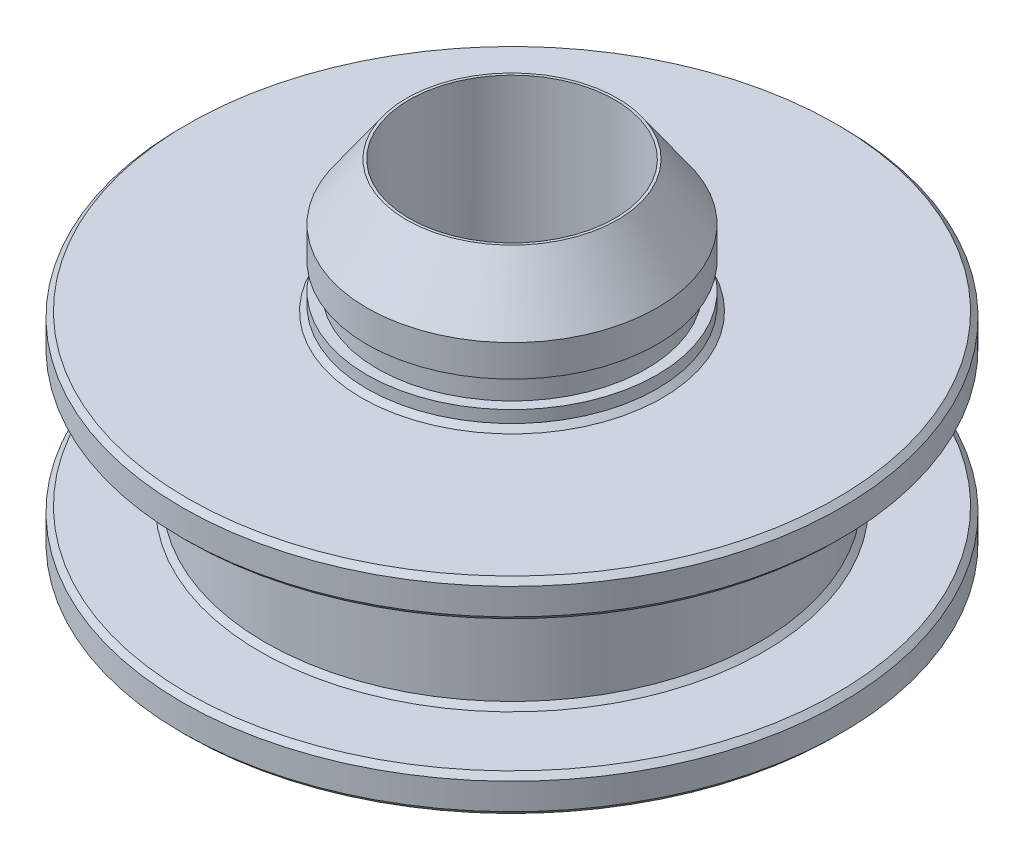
ISO-10303-21;
HEADER;
FILE_DESCRIPTION(('STEP AP214'),'2;1');
FILE_NAME('part.step','',(''),(''),'','','');
FILE_SCHEMA(('AUTOMOTIVE_DESIGN { 1 0 10303 214 1 1 1 1 }'));
ENDSEC;
DATA;
#1=APPLICATION_CONTEXT('core data for automotive mechanical design processes');
#2=APPLICATION_PROTOCOL_DEFINITION('international standard','automotive_design',2000,#1);
#3=PRODUCT_CONTEXT('',#1,'mechanical');
#4=PRODUCT('Part','Part','',(#3));
#5=PRODUCT_RELATED_PRODUCT_CATEGORY('part','',(#4));
#6=PRODUCT_DEFINITION_FORMATION('','',#4);
#7=PRODUCT_DEFINITION_CONTEXT('part definition',#1,'design');
#8=PRODUCT_DEFINITION('design','',#6,#7);
#9=PRODUCT_DEFINITION_SHAPE('','',#8);
#10=(LENGTH_UNIT() NAMED_UNIT(*) SI_UNIT(.MILLI.,.METRE.));
#11=(NAMED_UNIT(*) PLANE_ANGLE_UNIT() SI_UNIT($,.RADIAN.));
#12=(NAMED_UNIT(*) SI_UNIT($,.STERADIAN.) SOLID_ANGLE_UNIT());
#13=UNCERTAINTY_MEASURE_WITH_UNIT(LENGTH_MEASURE(1.E-05),#10,'distance_accuracy_value','');
#14=(GEOMETRIC_REPRESENTATION_CONTEXT(3) GLOBAL_UNCERTAINTY_ASSIGNED_CONTEXT((#13)) GLOBAL_UNIT_ASSIGNED_CONTEXT((#10,
#11,#12)) REPRESENTATION_CONTEXT('',''));
#15=CARTESIAN_POINT('',(0.,0.,0.));
#16=DIRECTION('',(0.,0.,1.));
#17=DIRECTION('',(1.,0.,0.));
#18=AXIS2_PLACEMENT_3D('',#15,#16,#17);
#19=CARTESIAN_POINT('',(0.,-0.889,0.));
#20=DIRECTION('',(0.,-1.,0.));
#21=DIRECTION('',(0.,0.,-1.));
#22=AXIS2_PLACEMENT_3D('',#19,#20,#21);
#23=PLANE('',#22);
#24=CARTESIAN_POINT('',(0.,-0.889,0.));
#25=DIRECTION('',(0.,-1.,0.));
#26=DIRECTION('',(0.,0.,-1.));
#27=AXIS2_PLACEMENT_3D('',#24,#25,#26);
#28=CIRCLE('',#27,7.8105);
#29=CARTESIAN_POINT('',(0.,-0.889,-7.8105));
#30=VERTEX_POINT('',#29);
#31=EDGE_CURVE('E52',#30,#30,#28,.T.);
#32=ORIENTED_EDGE('',*,*,#31,.T.);
#33=EDGE_LOOP('',(#32));
#34=FACE_BOUND('',#33,.T.);
#35=CARTESIAN_POINT('',(0.,-0.889,0.));
#36=DIRECTION('',(0.,-1.,0.));
#37=DIRECTION('',(0.,0.,-1.));
#38=AXIS2_PLACEMENT_3D('',#35,#36,#37);
#39=CIRCLE('',#38,4.572);
#40=CARTESIAN_POINT('',(0.,-0.889,-4.572));
#41=VERTEX_POINT('',#40);
#42=EDGE_CURVE('E55',#41,#41,#39,.F.);
#43=ORIENTED_EDGE('',*,*,#42,.T.);
#44=EDGE_LOOP('',(#43));
#45=FACE_BOUND('',#44,.T.);
#46=ADVANCED_FACE('F29',(#34,#45),#23,.T.);
#47=CARTESIAN_POINT('',(0.,4.064,0.));
#48=DIRECTION('',(0.,1.,0.));
#49=DIRECTION('',(0.,0.,1.));
#50=AXIS2_PLACEMENT_3D('',#47,#48,#49);
#51=PLANE('',#50);
#52=CARTESIAN_POINT('',(0.,4.064,0.));
#53=DIRECTION('',(0.,1.,0.));
#54=DIRECTION('',(0.,0.,1.));
#55=AXIS2_PLACEMENT_3D('',#52,#53,#54);
#56=CIRCLE('',#55,3.6195);
#57=CARTESIAN_POINT('',(0.,4.064,3.6195));
#58=VERTEX_POINT('',#57);
#59=EDGE_CURVE('E70',#58,#58,#56,.F.);
#60=ORIENTED_EDGE('',*,*,#59,.T.);
#61=EDGE_LOOP('',(#60));
#62=FACE_BOUND('',#61,.T.);
#63=CARTESIAN_POINT('',(0.,4.064,0.));
#64=DIRECTION('',(0.,1.,0.));
#65=DIRECTION('',(0.,0.,1.));
#66=AXIS2_PLACEMENT_3D('',#63,#64,#65);
#67=CIRCLE('',#66,7.8105);
#68=CARTESIAN_POINT('',(0.,4.064,7.8105));
#69=VERTEX_POINT('',#68);
#70=EDGE_CURVE('E73',#69,#69,#67,.T.);
#71=ORIENTED_EDGE('',*,*,#70,.T.);
#72=EDGE_LOOP('',(#71));
#73=FACE_BOUND('',#72,.T.);
#74=ADVANCED_FACE('F152',(#62,#73),#51,.T.);
#75=CARTESIAN_POINT('',(0.,3.175,0.));
#76=DIRECTION('',(0.,-1.,0.));
#77=DIRECTION('',(0.,0.,-1.));
#78=AXIS2_PLACEMENT_3D('',#75,#76,#77);
#79=CYLINDRICAL_SURFACE('',#78,5.9436);
#80=CARTESIAN_POINT('',(0.,3.048,0.));
#81=DIRECTION('',(0.,1.,0.));
#82=DIRECTION('',(0.,0.,1.));
#83=AXIS2_PLACEMENT_3D('',#80,#81,#82);
#84=CIRCLE('',#83,5.9436);
#85=CARTESIAN_POINT('',(0.,3.048,5.9436));
#86=VERTEX_POINT('',#85);
#87=EDGE_CURVE('E85',#86,#86,#84,.F.);
#88=ORIENTED_EDGE('',*,*,#87,.T.);
#89=EDGE_LOOP('',(#88));
#90=FACE_BOUND('',#89,.T.);
#91=CARTESIAN_POINT('',(0.,0.126999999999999,0.));
#92=DIRECTION('',(0.,-1.,0.));
#93=DIRECTION('',(0.,0.,-1.));
#94=AXIS2_PLACEMENT_3D('',#91,#92,#93);
#95=CIRCLE('',#94,5.9436);
#96=CARTESIAN_POINT('',(0.,0.126999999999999,-5.9436));
#97=VERTEX_POINT('',#96);
#98=EDGE_CURVE('E88',#97,#97,#95,.F.);
#99=ORIENTED_EDGE('',*,*,#98,.T.);
#100=EDGE_LOOP('',(#99));
#101=FACE_BOUND('',#100,.T.);
#102=ADVANCED_FACE('F31',(#90,#101),#79,.T.);
#103=CARTESIAN_POINT('',(0.,3.175,0.));
#104=DIRECTION('',(0.,1.,0.));
#105=DIRECTION('',(0.,0.,1.));
#106=AXIS2_PLACEMENT_3D('',#103,#104,#105);
#107=PLANE('',#106);
#108=CARTESIAN_POINT('',(0.,3.175,0.));
#109=DIRECTION('',(0.,1.,0.));
#110=DIRECTION('',(0.,0.,1.));
#111=AXIS2_PLACEMENT_3D('',#108,#109,#110);
#112=CIRCLE('',#111,6.0706);
#113=CARTESIAN_POINT('',(0.,3.175,6.0706));
#114=VERTEX_POINT('',#113);
#115=EDGE_CURVE('E91',#114,#114,#112,.T.);
#116=ORIENTED_EDGE('',*,*,#115,.T.);
#117=EDGE_LOOP('',(#116));
#118=FACE_BOUND('',#117,.T.);
#119=CARTESIAN_POINT('',(0.,3.175,0.));
#120=DIRECTION('',(0.,1.,0.));
#121=DIRECTION('',(0.,0.,1.));
#122=AXIS2_PLACEMENT_3D('',#119,#120,#121);
#123=CIRCLE('',#122,7.8105);
#124=CARTESIAN_POINT('',(0.,3.175,7.8105));
#125=VERTEX_POINT('',#124);
#126=EDGE_CURVE('E94',#125,#125,#123,.F.);
#127=ORIENTED_EDGE('',*,*,#126,.T.);
#128=EDGE_LOOP('',(#127));
#129=FACE_BOUND('',#128,.T.);
#130=ADVANCED_FACE('F332',(#118,#129),#107,.F.);
#131=CARTESIAN_POINT('',(0.,4.064,0.));
#132=DIRECTION('',(0.,-1.,0.));
#133=DIRECTION('',(0.,0.,-1.));
#134=AXIS2_PLACEMENT_3D('',#131,#132,#133);
#135=CYLINDRICAL_SURFACE('',#134,7.9375);
#136=CARTESIAN_POINT('',(0.,3.302,0.));
#137=DIRECTION('',(0.,1.,0.));
#138=DIRECTION('',(0.,0.,1.));
#139=AXIS2_PLACEMENT_3D('',#136,#137,#138);
#140=CIRCLE('',#139,7.9375);
#141=CARTESIAN_POINT('',(0.,3.302,7.9375));
#142=VERTEX_POINT('',#141);
#143=EDGE_CURVE('E64',#142,#142,#140,.T.);
#144=ORIENTED_EDGE('',*,*,#143,.T.);
#145=EDGE_LOOP('',(#144));
#146=FACE_BOUND('',#145,.T.);
#147=CARTESIAN_POINT('',(0.,3.937,0.));
#148=DIRECTION('',(0.,1.,0.));
#149=DIRECTION('',(0.,0.,1.));
#150=AXIS2_PLACEMENT_3D('',#147,#148,#149);
#151=CIRCLE('',#150,7.9375);
#152=CARTESIAN_POINT('',(0.,3.937,7.9375));
#153=VERTEX_POINT('',#152);
#154=EDGE_CURVE('E67',#153,#153,#151,.F.);
#155=ORIENTED_EDGE('',*,*,#154,.T.);
#156=EDGE_LOOP('',(#155));
#157=FACE_BOUND('',#156,.T.);
#158=ADVANCED_FACE('F149',(#146,#157),#135,.T.);
#159=CARTESIAN_POINT('',(0.,7.239,0.));
#160=DIRECTION('',(0.,-1.,0.));
#161=DIRECTION('',(0.,0.,-1.));
#162=AXIS2_PLACEMENT_3D('',#159,#160,#161);
#163=CYLINDRICAL_SURFACE('',#162,3.4925);
#164=CARTESIAN_POINT('',(0.,4.191,0.));
#165=DIRECTION('',(0.,1.,0.));
#166=DIRECTION('',(0.,0.,1.));
#167=AXIS2_PLACEMENT_3D('',#164,#165,#166);
#168=CIRCLE('',#167,3.4925);
#169=CARTESIAN_POINT('',(0.,4.191,3.4925));
#170=VERTEX_POINT('',#169);
#171=EDGE_CURVE('E76',#170,#170,#168,.T.);
#172=ORIENTED_EDGE('',*,*,#171,.T.);
#173=EDGE_LOOP('',(#172));
#174=FACE_BOUND('',#173,.T.);
#175=CARTESIAN_POINT('',(0.,4.48168902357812,0.));
#176=DIRECTION('',(0.,1.,0.));
#177=DIRECTION('',(0.,0.,1.));
#178=AXIS2_PLACEMENT_3D('',#175,#176,#177);
#179=CIRCLE('',#178,3.4925);
#180=CARTESIAN_POINT('',(0.,4.48168902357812,3.4925));
#181=VERTEX_POINT('',#180);
#182=EDGE_CURVE('E109',#181,#181,#179,.T.);
#183=ORIENTED_EDGE('',*,*,#182,.F.);
#184=EDGE_LOOP('',(#183));
#185=FACE_BOUND('',#184,.T.);
#186=ADVANCED_FACE('F139',(#174,#185),#163,.T.);
#187=CARTESIAN_POINT('',(-3.2385,5.11668902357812,0.));
#188=DIRECTION('',(0.,1.,0.));
#189=DIRECTION('',(0.,0.,1.));
#190=AXIS2_PLACEMENT_3D('',#187,#188,#189);
#191=PLANE('',#190);
#192=CARTESIAN_POINT('',(0.,5.11668902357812,0.));
#193=DIRECTION('',(0.,1.,0.));
#194=DIRECTION('',(0.,0.,1.));
#195=AXIS2_PLACEMENT_3D('',#192,#193,#194);
#196=CIRCLE('',#195,3.4925);
#197=CARTESIAN_POINT('',(0.,5.11668902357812,3.4925));
#198=VERTEX_POINT('',#197);
#199=EDGE_CURVE('E112',#198,#198,#196,.T.);
#200=ORIENTED_EDGE('',*,*,#199,.F.);
#201=EDGE_LOOP('',(#200));
#202=FACE_BOUND('',#201,.T.);
#203=CARTESIAN_POINT('',(0.,5.11668902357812,0.));
#204=DIRECTION('',(0.,1.,0.));
#205=DIRECTION('',(0.,0.,1.));
#206=AXIS2_PLACEMENT_3D('',#203,#204,#205);
#207=CIRCLE('',#206,3.2385);
#208=CARTESIAN_POINT('',(0.,5.11668902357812,3.2385));
#209=VERTEX_POINT('',#208);
#210=EDGE_CURVE('E103',#209,#209,#207,.T.);
#211=ORIENTED_EDGE('',*,*,#210,.T.);
#212=EDGE_LOOP('',(#211));
#213=FACE_BOUND('',#212,.T.);
#214=ADVANCED_FACE('F148',(#202,#213),#191,.F.);
#215=CARTESIAN_POINT('',(0.,7.239,0.));
#216=DIRECTION('',(0.,1.,0.));
#217=DIRECTION('',(0.,0.,1.));
#218=AXIS2_PLACEMENT_3D('',#215,#216,#217);
#219=CYLINDRICAL_SURFACE('',#218,3.2385);
#220=ORIENTED_EDGE('',*,*,#210,.F.);
#221=EDGE_LOOP('',(#220));
#222=FACE_BOUND('',#221,.T.);
#223=CARTESIAN_POINT('',(0.,4.48168902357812,0.));
#224=DIRECTION('',(0.,1.,0.));
#225=DIRECTION('',(0.,0.,1.));
#226=AXIS2_PLACEMENT_3D('',#223,#224,#225);
#227=CIRCLE('',#226,3.2385);
#228=CARTESIAN_POINT('',(0.,4.48168902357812,3.2385));
#229=VERTEX_POINT('',#228);
#230=EDGE_CURVE('E106',#229,#229,#227,.T.);
#231=ORIENTED_EDGE('',*,*,#230,.T.);
#232=EDGE_LOOP('',(#231));
#233=FACE_BOUND('',#232,.T.);
#234=ADVANCED_FACE('F169',(#222,#233),#219,.T.);
#235=CARTESIAN_POINT('',(-3.4925,4.48168902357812,0.));
#236=DIRECTION('',(0.,-1.,0.));
#237=DIRECTION('',(0.,0.,-1.));
#238=AXIS2_PLACEMENT_3D('',#235,#236,#237);
#239=PLANE('',#238);
#240=ORIENTED_EDGE('',*,*,#230,.F.);
#241=EDGE_LOOP('',(#240));
#242=FACE_BOUND('',#241,.T.);
#243=ORIENTED_EDGE('',*,*,#182,.T.);
#244=EDGE_LOOP('',(#243));
#245=FACE_BOUND('',#244,.T.);
#246=ADVANCED_FACE('F125',(#242,#245),#239,.F.);
#247=CARTESIAN_POINT('',(0.,7.239,0.));
#248=DIRECTION('',(0.,1.,0.));
#249=DIRECTION('',(0.,0.,1.));
#250=AXIS2_PLACEMENT_3D('',#247,#248,#249);
#251=PLANE('',#250);
#252=CARTESIAN_POINT('',(0.,7.239,0.));
#253=DIRECTION('',(0.,1.,0.));
#254=DIRECTION('',(0.,0.,1.));
#255=AXIS2_PLACEMENT_3D('',#252,#253,#254);
#256=CIRCLE('',#255,2.4765);
#257=CARTESIAN_POINT('',(0.,7.239,2.4765));
#258=VERTEX_POINT('',#257);
#259=EDGE_CURVE('E115',#258,#258,#256,.T.);
#260=ORIENTED_EDGE('',*,*,#259,.F.);
#261=EDGE_LOOP('',(#260));
#262=FACE_BOUND('',#261,.T.);
#263=CARTESIAN_POINT('',(0.,7.239,0.));
#264=DIRECTION('',(0.,1.,0.));
#265=DIRECTION('',(0.,0.,1.));
#266=AXIS2_PLACEMENT_3D('',#263,#264,#265);
#267=CIRCLE('',#266,2.54);
#268=CARTESIAN_POINT('',(0.,7.239,2.54));
#269=VERTEX_POINT('',#268);
#270=EDGE_CURVE('E100',#269,#269,#267,.T.);
#271=ORIENTED_EDGE('',*,*,#270,.T.);
#272=EDGE_LOOP('',(#271));
#273=FACE_BOUND('',#272,.T.);
#274=ADVANCED_FACE('F121',(#262,#273),#251,.T.);
#275=CARTESIAN_POINT('',(0.,5.87868902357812,0.));
#276=DIRECTION('',(0.,-1.,0.));
#277=DIRECTION('',(0.,0.,-1.));
#278=AXIS2_PLACEMENT_3D('',#275,#276,#277);
#279=CONICAL_SURFACE('',#278,3.4925,0.61086523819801);
#280=ORIENTED_EDGE('',*,*,#270,.F.);
#281=EDGE_LOOP('',(#280));
#282=FACE_BOUND('',#281,.T.);
#283=CARTESIAN_POINT('',(0.,5.87868902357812,0.));
#284=DIRECTION('',(0.,1.,0.));
#285=DIRECTION('',(0.,0.,1.));
#286=AXIS2_PLACEMENT_3D('',#283,#284,#285);
#287=CIRCLE('',#286,3.4925);
#288=CARTESIAN_POINT('',(0.,5.87868902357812,3.4925));
#289=VERTEX_POINT('',#288);
#290=EDGE_CURVE('E97',#289,#289,#287,.T.);
#291=ORIENTED_EDGE('',*,*,#290,.T.);
#292=EDGE_LOOP('',(#291));
#293=FACE_BOUND('',#292,.T.);
#294=ADVANCED_FACE('F124',(#282,#293),#279,.T.);
#295=ORIENTED_EDGE('',*,*,#199,.T.);
#296=EDGE_LOOP('',(#295));
#297=FACE_BOUND('',#296,.T.);
#298=ORIENTED_EDGE('',*,*,#290,.F.);
#299=EDGE_LOOP('',(#298));
#300=FACE_BOUND('',#299,.T.);
#301=ADVANCED_FACE('F131',(#297,#300),#163,.T.);
#302=CARTESIAN_POINT('',(0.,0.,0.));
#303=DIRECTION('',(0.,-1.,0.));
#304=DIRECTION('',(0.,0.,-1.));
#305=AXIS2_PLACEMENT_3D('',#302,#303,#304);
#306=PLANE('',#305);
#307=CARTESIAN_POINT('',(0.,0.,0.));
#308=DIRECTION('',(0.,-1.,0.));
#309=DIRECTION('',(0.,0.,-1.));
#310=AXIS2_PLACEMENT_3D('',#307,#308,#309);
#311=CIRCLE('',#310,6.0706);
#312=CARTESIAN_POINT('',(0.,0.,-6.0706));
#313=VERTEX_POINT('',#312);
#314=EDGE_CURVE('E79',#313,#313,#311,.T.);
#315=ORIENTED_EDGE('',*,*,#314,.T.);
#316=EDGE_LOOP('',(#315));
#317=FACE_BOUND('',#316,.T.);
#318=CARTESIAN_POINT('',(0.,0.,0.));
#319=DIRECTION('',(0.,-1.,0.));
#320=DIRECTION('',(0.,0.,-1.));
#321=AXIS2_PLACEMENT_3D('',#318,#319,#320);
#322=CIRCLE('',#321,7.8105);
#323=CARTESIAN_POINT('',(0.,0.,-7.8105));
#324=VERTEX_POINT('',#323);
#325=EDGE_CURVE('E82',#324,#324,#322,.F.);
#326=ORIENTED_EDGE('',*,*,#325,.T.);
#327=EDGE_LOOP('',(#326));
#328=FACE_BOUND('',#327,.T.);
#329=ADVANCED_FACE('F136',(#317,#328),#306,.F.);
#330=CARTESIAN_POINT('',(0.,-0.889,0.));
#331=DIRECTION('',(0.,1.,0.));
#332=DIRECTION('',(0.,0.,1.));
#333=AXIS2_PLACEMENT_3D('',#330,#331,#332);
#334=CYLINDRICAL_SURFACE('',#333,7.9375);
#335=CARTESIAN_POINT('',(0.,-0.127000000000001,0.));
#336=DIRECTION('',(0.,-1.,0.));
#337=DIRECTION('',(0.,0.,-1.));
#338=AXIS2_PLACEMENT_3D('',#335,#336,#337);
#339=CIRCLE('',#338,7.9375);
#340=CARTESIAN_POINT('',(0.,-0.127000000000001,-7.9375));
#341=VERTEX_POINT('',#340);
#342=EDGE_CURVE('E58',#341,#341,#339,.T.);
#343=ORIENTED_EDGE('',*,*,#342,.T.);
#344=EDGE_LOOP('',(#343));
#345=FACE_BOUND('',#344,.T.);
#346=CARTESIAN_POINT('',(0.,-0.762000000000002,0.));
#347=DIRECTION('',(0.,-1.,0.));
#348=DIRECTION('',(0.,0.,-1.));
#349=AXIS2_PLACEMENT_3D('',#346,#347,#348);
#350=CIRCLE('',#349,7.9375);
#351=CARTESIAN_POINT('',(0.,-0.762000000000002,-7.9375));
#352=VERTEX_POINT('',#351);
#353=EDGE_CURVE('E61',#352,#352,#350,.F.);
#354=ORIENTED_EDGE('',*,*,#353,.T.);
#355=EDGE_LOOP('',(#354));
#356=FACE_BOUND('',#355,.T.);
#357=ADVANCED_FACE('F143',(#345,#356),#334,.T.);
#358=CARTESIAN_POINT('',(0.,-1.905,0.));
#359=DIRECTION('',(0.,1.,0.));
#360=DIRECTION('',(0.,0.,1.));
#361=AXIS2_PLACEMENT_3D('',#358,#359,#360);
#362=CYLINDRICAL_SURFACE('',#361,4.445);
#363=CARTESIAN_POINT('',(0.,-1.016,0.));
#364=DIRECTION('',(0.,-1.,0.));
#365=DIRECTION('',(0.,0.,-1.));
#366=AXIS2_PLACEMENT_3D('',#363,#364,#365);
#367=CIRCLE('',#366,4.445);
#368=CARTESIAN_POINT('',(0.,-1.016,-4.445));
#369=VERTEX_POINT('',#368);
#370=EDGE_CURVE('E44',#369,#369,#367,.T.);
#371=ORIENTED_EDGE('',*,*,#370,.T.);
#372=EDGE_LOOP('',(#371));
#373=FACE_BOUND('',#372,.T.);
#374=CARTESIAN_POINT('',(0.,-1.778,0.));
#375=DIRECTION('',(0.,-1.,0.));
#376=DIRECTION('',(0.,0.,-1.));
#377=AXIS2_PLACEMENT_3D('',#374,#375,#376);
#378=CIRCLE('',#377,4.445);
#379=CARTESIAN_POINT('',(0.,-1.778,-4.445));
#380=VERTEX_POINT('',#379);
#381=EDGE_CURVE('E49',#380,#380,#378,.F.);
#382=ORIENTED_EDGE('',*,*,#381,.T.);
#383=EDGE_LOOP('',(#382));
#384=FACE_BOUND('',#383,.T.);
#385=ADVANCED_FACE('F165',(#373,#384),#362,.T.);
#386=CARTESIAN_POINT('',(0.,-1.905,0.));
#387=DIRECTION('',(0.,-1.,0.));
#388=DIRECTION('',(0.,0.,-1.));
#389=AXIS2_PLACEMENT_3D('',#386,#387,#388);
#390=PLANE('',#389);
#391=CARTESIAN_POINT('',(0.,-1.905,0.));
#392=DIRECTION('',(0.,-1.,0.));
#393=DIRECTION('',(0.,0.,-1.));
#394=AXIS2_PLACEMENT_3D('',#391,#392,#393);
#395=CIRCLE('',#394,2.6035);
#396=CARTESIAN_POINT('',(0.,-1.905,-2.6035));
#397=VERTEX_POINT('',#396);
#398=EDGE_CURVE('E36',#397,#397,#395,.F.);
#399=ORIENTED_EDGE('',*,*,#398,.T.);
#400=EDGE_LOOP('',(#399));
#401=FACE_BOUND('',#400,.T.);
#402=CARTESIAN_POINT('',(0.,-1.905,0.));
#403=DIRECTION('',(0.,-1.,0.));
#404=DIRECTION('',(0.,0.,-1.));
#405=AXIS2_PLACEMENT_3D('',#402,#403,#404);
#406=CIRCLE('',#405,4.318);
#407=CARTESIAN_POINT('',(0.,-1.905,-4.318));
#408=VERTEX_POINT('',#407);
#409=EDGE_CURVE('E40',#408,#408,#406,.T.);
#410=ORIENTED_EDGE('',*,*,#409,.T.);
#411=EDGE_LOOP('',(#410));
#412=FACE_BOUND('',#411,.T.);
#413=ADVANCED_FACE('F215',(#401,#412),#390,.T.);
#414=CARTESIAN_POINT('',(0.,-1.905,0.));
#415=DIRECTION('',(0.,1.,0.));
#416=DIRECTION('',(0.,0.,1.));
#417=AXIS2_PLACEMENT_3D('',#414,#415,#416);
#418=CYLINDRICAL_SURFACE('',#417,2.4765);
#419=CARTESIAN_POINT('',(0.,-1.778,0.));
#420=DIRECTION('',(0.,-1.,0.));
#421=DIRECTION('',(0.,0.,-1.));
#422=AXIS2_PLACEMENT_3D('',#419,#420,#421);
#423=CIRCLE('',#422,2.4765);
#424=CARTESIAN_POINT('',(0.,-1.778,-2.4765));
#425=VERTEX_POINT('',#424);
#426=EDGE_CURVE('E10',#425,#425,#423,.T.);
#427=ORIENTED_EDGE('',*,*,#426,.T.);
#428=EDGE_LOOP('',(#427));
#429=FACE_BOUND('',#428,.T.);
#430=ORIENTED_EDGE('',*,*,#259,.T.);
#431=EDGE_LOOP('',(#430));
#432=FACE_BOUND('',#431,.T.);
#433=ADVANCED_FACE('F119',(#429,#432),#418,.F.);
#434=CARTESIAN_POINT('',(0.,3.175,0.));
#435=DIRECTION('',(0.,1.,0.));
#436=DIRECTION('',(0.,0.,1.));
#437=AXIS2_PLACEMENT_3D('',#434,#435,#436);
#438=CONICAL_SURFACE('',#437,6.0706,0.785398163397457);
#439=ORIENTED_EDGE('',*,*,#87,.F.);
#440=EDGE_LOOP('',(#439));
#441=FACE_BOUND('',#440,.T.);
#442=ORIENTED_EDGE('',*,*,#115,.F.);
#443=EDGE_LOOP('',(#442));
#444=FACE_BOUND('',#443,.T.);
#445=ADVANCED_FACE('F228',(#441,#444),#438,.T.);
#446=CARTESIAN_POINT('',(0.,0.,0.));
#447=DIRECTION('',(0.,-1.,0.));
#448=DIRECTION('',(0.,0.,-1.));
#449=AXIS2_PLACEMENT_3D('',#446,#447,#448);
#450=CONICAL_SURFACE('',#449,6.0706,0.785398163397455);
#451=ORIENTED_EDGE('',*,*,#98,.F.);
#452=EDGE_LOOP('',(#451));
#453=FACE_BOUND('',#452,.T.);
#454=ORIENTED_EDGE('',*,*,#314,.F.);
#455=EDGE_LOOP('',(#454));
#456=FACE_BOUND('',#455,.T.);
#457=ADVANCED_FACE('F235',(#453,#456),#450,.T.);
#458=CARTESIAN_POINT('',(0.,4.191,0.));
#459=DIRECTION('',(0.,-1.,0.));
#460=DIRECTION('',(0.,0.,-1.));
#461=AXIS2_PLACEMENT_3D('',#458,#459,#460);
#462=CONICAL_SURFACE('',#461,3.4925,0.785398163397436);
#463=ORIENTED_EDGE('',*,*,#59,.F.);
#464=EDGE_LOOP('',(#463));
#465=FACE_BOUND('',#464,.T.);
#466=ORIENTED_EDGE('',*,*,#171,.F.);
#467=EDGE_LOOP('',(#466));
#468=FACE_BOUND('',#467,.T.);
#469=ADVANCED_FACE('F243',(#465,#468),#462,.T.);
#470=CARTESIAN_POINT('',(0.,3.302,0.));
#471=DIRECTION('',(0.,1.,0.));
#472=DIRECTION('',(0.,0.,1.));
#473=AXIS2_PLACEMENT_3D('',#470,#471,#472);
#474=CONICAL_SURFACE('',#473,7.9375,0.785398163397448);
#475=ORIENTED_EDGE('',*,*,#126,.F.);
#476=EDGE_LOOP('',(#475));
#477=FACE_BOUND('',#476,.T.);
#478=ORIENTED_EDGE('',*,*,#143,.F.);
#479=EDGE_LOOP('',(#478));
#480=FACE_BOUND('',#479,.T.);
#481=ADVANCED_FACE('F251',(#477,#480),#474,.T.);
#482=CARTESIAN_POINT('',(0.,4.064,0.));
#483=DIRECTION('',(0.,-1.,0.));
#484=DIRECTION('',(0.,0.,-1.));
#485=AXIS2_PLACEMENT_3D('',#482,#483,#484);
#486=CONICAL_SURFACE('',#485,7.8105,0.785398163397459);
#487=ORIENTED_EDGE('',*,*,#154,.F.);
#488=EDGE_LOOP('',(#487));
#489=FACE_BOUND('',#488,.T.);
#490=ORIENTED_EDGE('',*,*,#70,.F.);
#491=EDGE_LOOP('',(#490));
#492=FACE_BOUND('',#491,.T.);
#493=ADVANCED_FACE('F259',(#489,#492),#486,.T.);
#494=CARTESIAN_POINT('',(0.,-0.127000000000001,0.));
#495=DIRECTION('',(0.,-1.,0.));
#496=DIRECTION('',(0.,0.,-1.));
#497=AXIS2_PLACEMENT_3D('',#494,#495,#496);
#498=CONICAL_SURFACE('',#497,7.9375,0.785398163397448);
#499=ORIENTED_EDGE('',*,*,#325,.F.);
#500=EDGE_LOOP('',(#499));
#501=FACE_BOUND('',#500,.T.);
#502=ORIENTED_EDGE('',*,*,#342,.F.);
#503=EDGE_LOOP('',(#502));
#504=FACE_BOUND('',#503,.T.);
#505=ADVANCED_FACE('F267',(#501,#504),#498,.T.);
#506=CARTESIAN_POINT('',(0.,-0.889,0.));
#507=DIRECTION('',(0.,1.,0.));
#508=DIRECTION('',(0.,0.,1.));
#509=AXIS2_PLACEMENT_3D('',#506,#507,#508);
#510=CONICAL_SURFACE('',#509,7.8105,0.785398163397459);
#511=ORIENTED_EDGE('',*,*,#353,.F.);
#512=EDGE_LOOP('',(#511));
#513=FACE_BOUND('',#512,.T.);
#514=ORIENTED_EDGE('',*,*,#31,.F.);
#515=EDGE_LOOP('',(#514));
#516=FACE_BOUND('',#515,.T.);
#517=ADVANCED_FACE('F275',(#513,#516),#510,.T.);
#518=CARTESIAN_POINT('',(0.,-1.016,0.));
#519=DIRECTION('',(0.,1.,0.));
#520=DIRECTION('',(0.,0.,1.));
#521=AXIS2_PLACEMENT_3D('',#518,#519,#520);
#522=CONICAL_SURFACE('',#521,4.445,0.785398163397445);
#523=ORIENTED_EDGE('',*,*,#42,.F.);
#524=EDGE_LOOP('',(#523));
#525=FACE_BOUND('',#524,.T.);
#526=ORIENTED_EDGE('',*,*,#370,.F.);
#527=EDGE_LOOP('',(#526));
#528=FACE_BOUND('',#527,.T.);
#529=ADVANCED_FACE('F283',(#525,#528),#522,.T.);
#530=CARTESIAN_POINT('',(0.,-1.905,0.));
#531=DIRECTION('',(0.,-1.,0.));
#532=DIRECTION('',(0.,0.,-1.));
#533=AXIS2_PLACEMENT_3D('',#530,#531,#532);
#534=CONICAL_SURFACE('',#533,2.6035,0.785398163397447);
#535=ORIENTED_EDGE('',*,*,#426,.F.);
#536=EDGE_LOOP('',(#535));
#537=FACE_BOUND('',#536,.T.);
#538=ORIENTED_EDGE('',*,*,#398,.F.);
#539=EDGE_LOOP('',(#538));
#540=FACE_BOUND('',#539,.T.);
#541=ADVANCED_FACE('F291',(#537,#540),#534,.F.);
#542=CARTESIAN_POINT('',(0.,-1.905,0.));
#543=DIRECTION('',(0.,1.,0.));
#544=DIRECTION('',(0.,0.,1.));
#545=AXIS2_PLACEMENT_3D('',#542,#543,#544);
#546=CONICAL_SURFACE('',#545,4.318,0.785398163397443);
#547=ORIENTED_EDGE('',*,*,#381,.F.);
#548=EDGE_LOOP('',(#547));
#549=FACE_BOUND('',#548,.T.);
#550=ORIENTED_EDGE('',*,*,#409,.F.);
#551=EDGE_LOOP('',(#550));
#552=FACE_BOUND('',#551,.T.);
#553=ADVANCED_FACE('F299',(#549,#552),#546,.T.);
#554=CLOSED_SHELL('',(#46,#74,#102,#130,#158,#186,#214,#234,#246,#274,#294,#301,#329,#357,#385,
#413,#433,#445,#457,#469,#481,#493,#505,#517,#529,#541,#553));
#555=MANIFOLD_SOLID_BREP('B2',#554);
#556=ADVANCED_BREP_SHAPE_REPRESENTATION('',(#18,#555),#14);
#557=SHAPE_DEFINITION_REPRESENTATION(#9,#556);
ENDSEC;
END-ISO-10303-21;
